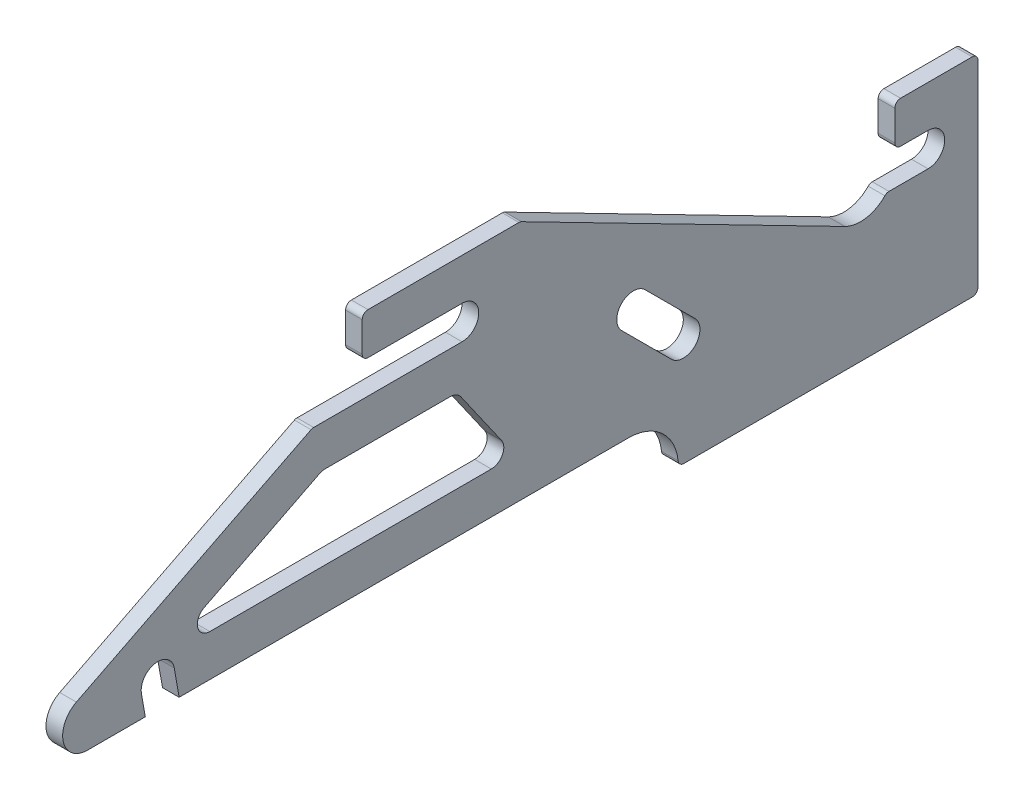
from build123d import *

# Parameters (mm, degrees)
RESSALTO_EXTRUS_O1_DEPTH = 2
CORTE_EXTRUS_O1_DEPTH    = 116.451288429


with BuildPart() as part:
    # Esbo_o1 → Ressalto-extrus_o1 (new body)
    with BuildSketch(Plane(origin=(0, 0, 0), x_dir=(0, 0, -1), z_dir=(1, 0, 0))):
        with BuildLine():
            Line((0, 24.303568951), (0, 0.696431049))
            ThreePointArc((0, 0.696431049), (-0.203979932, 0.203979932), (-0.696431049, 0))
            Line((-0.696431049, 0), (-35.339881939, 0))
            ThreePointArc((-35.339881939, 0), (-35.806022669, 0.179005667), (-36.032536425, 0.624001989))
            ThreePointArc((-36.032536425, 0.624001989), (-37.984032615, 4.457802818), (-42, 6))
            Line((-42, 6), (-96, 6))
            Line((-96, 6), (-96.59021866, 9.347296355))
            ThreePointArc((-96.59021866, 9.347296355), (-98.907130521, 10.969615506), (-100.529449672, 8.652703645))
            Line((-100.529449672, 8.652703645), (-100.061706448, 6))
            Line((-100.061706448, 6), (-107, 6))
            ThreePointArc((-107, 6), (-109.918324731, 8.304744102), (-108.352654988, 11.677746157))
            Line((-108.352654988, 11.677746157), (-80.148093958, 25.925190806))
            ThreePointArc((-80.148093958, 25.925190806), (-79.995482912, 25.981039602), (-79.834083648, 26))
            Line((-79.834083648, 26), (-62, 26))
            ThreePointArc((-62, 26), (-60, 28), (-62, 30))
            Line((-62, 30), (-73.303568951, 30))
            ThreePointArc((-73.303568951, 30), (-73.796020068, 30.203979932), (-74, 30.696431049))
            Line((-74, 30.696431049), (-74, 34.303568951))
            ThreePointArc((-74, 34.303568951), (-73.796020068, 34.796020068), (-73.303568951, 35))
            Line((-73.303568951, 35), (-55.168160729, 35))
            ThreePointArc((-55.168160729, 35), (-55.004697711, 34.980544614), (-54.850367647, 34.92326546))
            Line((-54.850367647, 34.92326546), (-16, 15))
            ThreePointArc((-16, 15), (-13.465644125, 14.602459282), (-11.191291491, 15.789185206))
            ThreePointArc((-11.191291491, 15.789185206), (-10.963040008, 15.945135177), (-10.692099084, 16))
            Line((-10.692099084, 16), (-6, 16))
            ThreePointArc((-6, 16), (-4, 18), (-6, 20))
            Line((-6, 20), (-9.303568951, 20))
            ThreePointArc((-9.303568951, 20), (-9.796020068, 20.203979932), (-10, 20.696431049))
            Line((-10, 20.696431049), (-10, 24.303568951))
            ThreePointArc((-10, 24.303568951), (-9.796020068, 24.796020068), (-9.303568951, 25))
            Line((-9.303568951, 25), (-0.696431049, 25))
            ThreePointArc((-0.696431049, 25), (-0.203979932, 24.796020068), (0, 24.303568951))
        make_face()
        with BuildLine():
            Line((-92.308809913, 11), (-58.486017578, 11))
            ThreePointArc((-58.486017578, 11), (-57.155549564, 11.807284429), (-57.257169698, 13.360193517))
            Line((-57.257169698, 13.360193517), (-62.157169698, 20.360193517))
            ThreePointArc((-62.157169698, 20.360193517), (-62.693302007, 20.830468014), (-63.386017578, 21))
            Line((-63.386017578, 21), (-78.451452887, 21))
            ThreePointArc((-78.451452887, 21), (-78.799080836, 20.959162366), (-79.127780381, 20.838873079))
            Line((-79.127780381, 20.838873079), (-92.985137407, 13.838873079))
            ThreePointArc((-92.985137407, 13.838873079), (-93.767972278, 12.152372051), (-92.308809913, 11))
        make_face(mode=Mode.SUBTRACT)
    extrude(amount=RESSALTO_EXTRUS_O1_DEPTH)

    # Esbo_o2 → Corte-extrus_o1 (cut, through all)
    with BuildSketch(Plane(origin=(2, 0, 0), x_dir=(0, 0, -1), z_dir=(1, 0, 0))):
        with BuildLine():
            Line((-40, 20.414213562), (-34, 14.414213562))
            ThreePointArc((-34, 14.414213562), (-34, 11.585786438), (-36.828427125, 11.585786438))
            Line((-36.828427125, 11.585786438), (-42.828427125, 17.585786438))
            ThreePointArc((-42.828427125, 17.585786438), (-42.828427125, 20.414213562), (-40, 20.414213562))
        make_face()
    extrude(amount=-CORTE_EXTRUS_O1_DEPTH, mode=Mode.SUBTRACT)


solid = part.part
